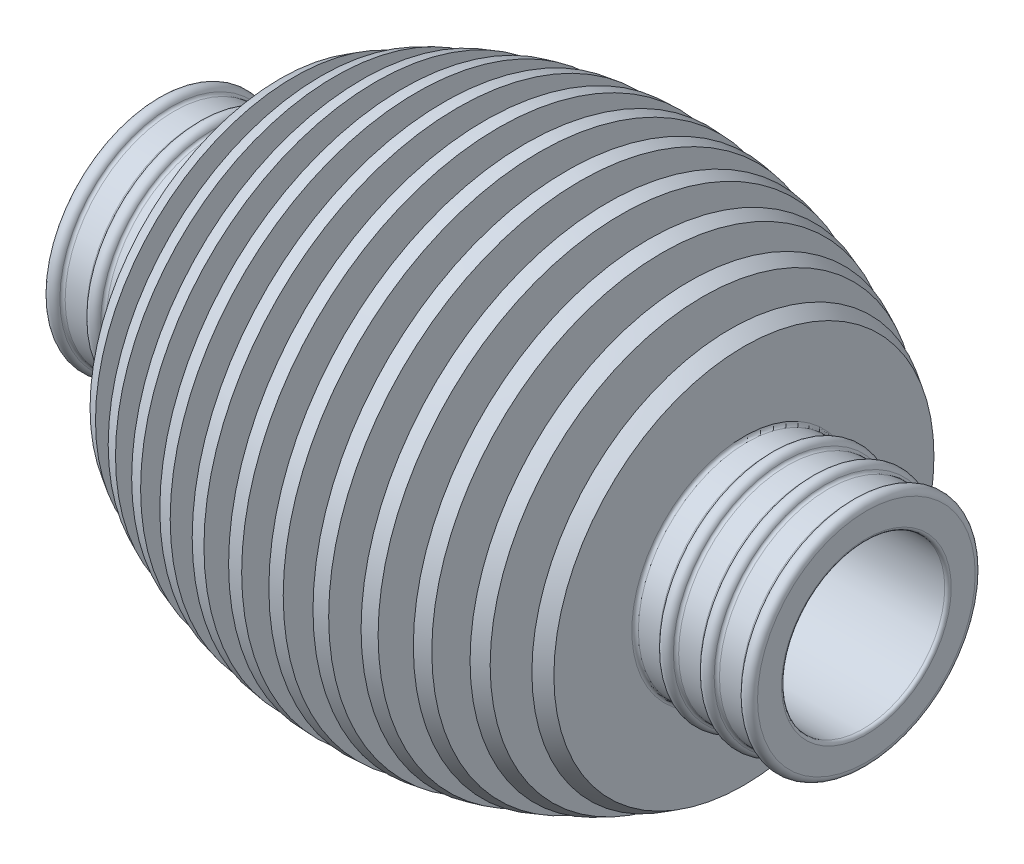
from build123d import *

# Parameters (mm, degrees)
FILLET1_R = 0.381


with BuildPart() as part:
    # Sketch1 → Revolve1 (revolve)
    with BuildSketch(Plane.XY, mode=Mode.PRIVATE) as revolve1_sk:
        with BuildLine():
            Line((0, 9.525), (0, 12.7))
            ThreePointArc((0, 12.7), (0.79502, 13.49502), (1.59004, 12.7))
            Line((1.59004, 12.7), (4.7625, 12.7))
            ThreePointArc((4.7625, 12.7), (5.55752, 13.49502), (6.35254, 12.7))
            Line((6.35254, 12.7), (9.525, 12.7))
            ThreePointArc((9.525, 12.7), (10.32002, 13.49502), (11.11504, 12.7))
            Line((11.11504, 12.7), (14.29004, 12.7))
            Line((14.29004, 12.7), (14.29004, 31.75))
            Line((14.29004, 31.75), (15.89024, 31.75))
            Line((15.89024, 31.75), (15.89024, 12.7))
            Line((15.89024, 12.7), (19.06524, 12.7))
            Line((19.06524, 12.7), (19.06524, 31.75))
            Line((19.06524, 31.75), (20.66544, 31.75))
            Line((20.66544, 31.75), (20.66544, 12.7))
            Line((20.66544, 12.7), (23.84044, 12.7))
            Line((23.84044, 12.7), (23.84044, 31.75))
            Line((23.84044, 31.75), (25.44064, 31.75))
            Line((25.44064, 31.75), (25.44064, 12.7))
            Line((25.44064, 12.7), (28.61564, 12.7))
            Line((28.61564, 12.7), (28.61564, 31.75))
            Line((28.61564, 31.75), (30.21584, 31.75))
            Line((30.21584, 31.75), (30.21584, 12.7))
            Line((30.21584, 12.7), (33.39084, 12.7))
            Line((33.39084, 12.7), (33.39084, 31.75))
            Line((33.39084, 31.75), (34.99104, 31.75))
            Line((34.99104, 31.75), (34.99104, 12.7))
            Line((34.99104, 12.7), (38.16604, 12.7))
            Line((38.16604, 12.7), (38.16604, 31.75))
            Line((38.16604, 31.75), (39.76624, 31.75))
            Line((39.76624, 31.75), (39.76624, 12.7))
            Line((39.76624, 12.7), (42.94124, 12.7))
            Line((42.94124, 12.7), (42.94124, 31.75))
            Line((42.94124, 31.75), (44.54144, 31.75))
            Line((44.54144, 31.75), (44.54144, 12.7))
            Line((44.54144, 12.7), (47.71644, 12.7))
            Line((47.71644, 12.7), (47.71644, 31.75))
            Line((47.71644, 31.75), (49.31664, 31.75))
            Line((49.31664, 31.75), (49.31664, 12.7))
            Line((49.31664, 12.7), (52.49164, 12.7))
            Line((52.49164, 12.7), (52.49164, 31.75))
            Line((52.49164, 31.75), (54.09184, 31.75))
            Line((54.09184, 31.75), (54.09184, 12.7))
            Line((54.09184, 12.7), (57.26684, 12.7))
            Line((57.26684, 12.7), (57.26684, 31.75))
            Line((57.26684, 31.75), (58.86704, 31.75))
            Line((58.86704, 31.75), (58.86704, 12.7))
            Line((58.86704, 12.7), (62.04204, 12.7))
            Line((62.04204, 12.7), (62.04204, 31.75))
            Line((62.04204, 31.75), (63.64224, 31.75))
            Line((63.64224, 31.75), (63.64224, 12.7))
            Line((63.64224, 12.7), (66.81724, 12.7))
            Line((66.81724, 12.7), (66.81724, 31.75))
            Line((66.81724, 31.75), (68.41744, 31.75))
            Line((68.41744, 31.75), (68.41744, 12.7))
            Line((68.41744, 12.7), (71.59244, 12.7))
            ThreePointArc((71.59244, 12.7), (72.38746, 13.49502), (73.18248, 12.7))
            Line((73.18248, 12.7), (76.35494, 12.7))
            ThreePointArc((76.35494, 12.7), (77.14996, 13.49502), (77.94498, 12.7))
            Line((77.94498, 12.7), (81.11744, 12.7))
            ThreePointArc((81.11744, 12.7), (81.91246, 13.49502), (82.70748, 12.7))
            Line((82.70748, 12.7), (82.70748, 9.525))
            Line((82.70748, 9.525), (0, 9.525))
        make_face()
    revolve(revolve1_sk.sketch.rotate(Axis((0, 0, 0), (-1, 0, 0)), 90), axis=Axis((0, 0, 0), (-1, 0, 0)))

    # Sketch2 → Cut-Revolve1 (revolve, cut)
    with BuildSketch(Plane.XY, mode=Mode.PRIVATE) as cut_revolve1_sk:
        with BuildLine():
            Line((3.17627, 12.7), (3.17627, 38.1))
            Line((3.17627, 38.1), (79.53121, 38.1))
            Line((79.53121, 38.1), (79.53121, 12.7))
            ThreePointArc((79.53121, 12.7), (41.35374, 29.987005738), (3.17627, 12.7))
        make_face()
    revolve(cut_revolve1_sk.sketch.rotate(Axis((0, 0, 0), (-1, 0, 0)), 270), axis=Axis((0, 0, 0), (-1, 0, 0)), mode=Mode.SUBTRACT)

    # Fillet1
    fillet1_edges = [part.edges().sort_by_distance(p)[0] for p in [
        (0, 0, 9.525),
        (1.59004, 0, 12.7),
        (4.7625, 0, 12.7),
        (6.35254, 0, 12.7),
        (9.525, 0, 12.7),
        (11.11504, 0, 12.7),
        (14.29004, 0, 12.7),
        (15.89024, 0, 12.7),
        (19.06524, 0, 12.7),
        (20.66544, 0, 12.7),
        (23.84044, 0, 12.7),
        (25.44064, 0, 12.7),
        (28.61564, 0, 12.7),
        (30.21584, 0, 12.7),
        (33.39084, 0, 12.7),
        (34.99104, 0, 12.7),
        (38.16604, 0, 12.7),
        (39.76624, 0, 12.7),
        (42.94124, 0, 12.7),
        (44.54144, 0, 12.7),
        (47.71644, 0, 12.7),
        (49.31664, 0, 12.7),
        (52.49164, 0, 12.7),
        (54.09184, 0, 12.7),
        (57.26684, 0, 12.7),
        (58.86704, 0, 12.7),
        (62.04204, 0, 12.7),
        (63.64224, 0, 12.7),
        (66.81724, 0, 12.7),
        (68.41744, 0, 12.7),
        (71.59244, 0, 12.7),
        (73.18248, 0, 12.7),
        (76.35494, 0, 12.7),
        (77.94498, 0, 12.7),
        (81.11744, 0, 12.7),
        (82.70748, 0, 9.525),
    ]]
    fillet(fillet1_edges, radius=FILLET1_R)


solid = part.part
